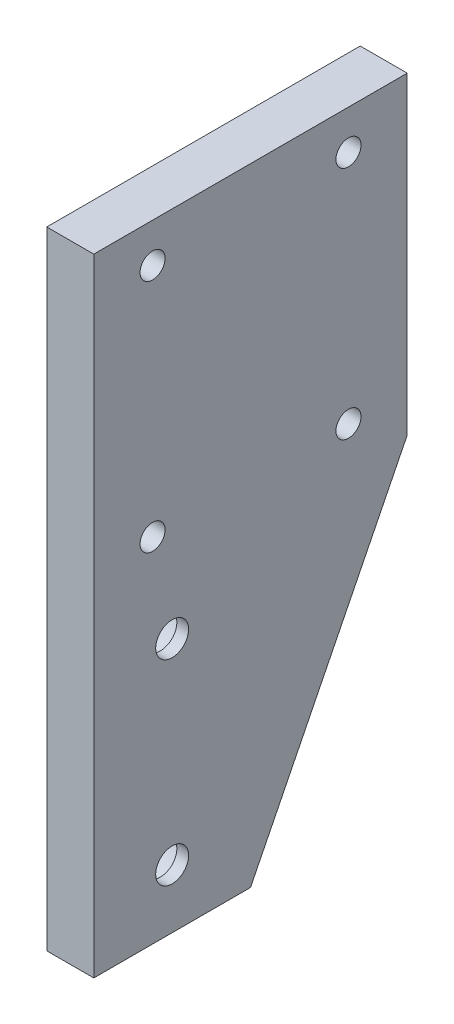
ISO-10303-21;
HEADER;
FILE_DESCRIPTION(('STEP AP214'),'2;1');
FILE_NAME('part.step','',(''),(''),'','','');
FILE_SCHEMA(('AUTOMOTIVE_DESIGN { 1 0 10303 214 1 1 1 1 }'));
ENDSEC;
DATA;
#1=APPLICATION_CONTEXT('core data for automotive mechanical design processes');
#2=APPLICATION_PROTOCOL_DEFINITION('international standard','automotive_design',2000,#1);
#3=PRODUCT_CONTEXT('',#1,'mechanical');
#4=PRODUCT('Part','Part','',(#3));
#5=PRODUCT_RELATED_PRODUCT_CATEGORY('part','',(#4));
#6=PRODUCT_DEFINITION_FORMATION('','',#4);
#7=PRODUCT_DEFINITION_CONTEXT('part definition',#1,'design');
#8=PRODUCT_DEFINITION('design','',#6,#7);
#9=PRODUCT_DEFINITION_SHAPE('','',#8);
#10=(LENGTH_UNIT() NAMED_UNIT(*) SI_UNIT(.MILLI.,.METRE.));
#11=(NAMED_UNIT(*) PLANE_ANGLE_UNIT() SI_UNIT($,.RADIAN.));
#12=(NAMED_UNIT(*) SI_UNIT($,.STERADIAN.) SOLID_ANGLE_UNIT());
#13=UNCERTAINTY_MEASURE_WITH_UNIT(LENGTH_MEASURE(1.E-05),#10,'distance_accuracy_value','');
#14=(GEOMETRIC_REPRESENTATION_CONTEXT(3) GLOBAL_UNCERTAINTY_ASSIGNED_CONTEXT((#13)) GLOBAL_UNIT_ASSIGNED_CONTEXT((#10,
#11,#12)) REPRESENTATION_CONTEXT('',''));
#15=CARTESIAN_POINT('',(0.,0.,0.));
#16=DIRECTION('',(0.,0.,1.));
#17=DIRECTION('',(1.,0.,0.));
#18=AXIS2_PLACEMENT_3D('',#15,#16,#17);
#19=CARTESIAN_POINT('',(0.,70.,-25.));
#20=DIRECTION('',(-1.,0.,0.));
#21=DIRECTION('',(0.,0.,1.));
#22=AXIS2_PLACEMENT_3D('',#19,#20,#21);
#23=CYLINDRICAL_SURFACE('',#22,5.50000000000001);
#24=CARTESIAN_POINT('',(0.,70.,-25.));
#25=DIRECTION('',(-1.,0.,0.));
#26=DIRECTION('',(0.,0.,1.));
#27=AXIS2_PLACEMENT_3D('',#24,#25,#26);
#28=CIRCLE('',#27,5.50000000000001);
#29=CARTESIAN_POINT('',(0.,70.,-19.5));
#30=VERTEX_POINT('',#29);
#31=EDGE_CURVE('E138',#30,#30,#28,.F.);
#32=ORIENTED_EDGE('',*,*,#31,.F.);
#33=EDGE_LOOP('',(#32));
#34=FACE_BOUND('',#33,.T.);
#35=CARTESIAN_POINT('',(6.8,70.,-25.));
#36=DIRECTION('',(-1.,0.,0.));
#37=DIRECTION('',(0.,0.,1.));
#38=AXIS2_PLACEMENT_3D('',#35,#36,#37);
#39=CIRCLE('',#38,5.50000000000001);
#40=CARTESIAN_POINT('',(6.8,70.,-19.5));
#41=VERTEX_POINT('',#40);
#42=EDGE_CURVE('E20',#41,#41,#39,.F.);
#43=ORIENTED_EDGE('',*,*,#42,.T.);
#44=EDGE_LOOP('',(#43));
#45=FACE_BOUND('',#44,.T.);
#46=ADVANCED_FACE('F17',(#34,#45),#23,.F.);
#47=CARTESIAN_POINT('',(0.,70.,25.));
#48=DIRECTION('',(-1.,0.,0.));
#49=DIRECTION('',(0.,0.,1.));
#50=AXIS2_PLACEMENT_3D('',#47,#48,#49);
#51=CYLINDRICAL_SURFACE('',#50,5.50000000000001);
#52=CARTESIAN_POINT('',(0.,70.,25.));
#53=DIRECTION('',(-1.,0.,0.));
#54=DIRECTION('',(0.,0.,1.));
#55=AXIS2_PLACEMENT_3D('',#52,#53,#54);
#56=CIRCLE('',#55,5.50000000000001);
#57=CARTESIAN_POINT('',(0.,70.,30.5));
#58=VERTEX_POINT('',#57);
#59=EDGE_CURVE('E135',#58,#58,#56,.F.);
#60=ORIENTED_EDGE('',*,*,#59,.F.);
#61=EDGE_LOOP('',(#60));
#62=FACE_BOUND('',#61,.T.);
#63=CARTESIAN_POINT('',(6.8,70.,25.));
#64=DIRECTION('',(-1.,0.,0.));
#65=DIRECTION('',(0.,0.,1.));
#66=AXIS2_PLACEMENT_3D('',#63,#64,#65);
#67=CIRCLE('',#66,5.50000000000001);
#68=CARTESIAN_POINT('',(6.8,70.,30.5));
#69=VERTEX_POINT('',#68);
#70=EDGE_CURVE('E152',#69,#69,#67,.F.);
#71=ORIENTED_EDGE('',*,*,#70,.T.);
#72=EDGE_LOOP('',(#71));
#73=FACE_BOUND('',#72,.T.);
#74=ADVANCED_FACE('F257',(#62,#73),#51,.F.);
#75=CARTESIAN_POINT('',(0.,9.99999999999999,-25.));
#76=DIRECTION('',(-1.,0.,0.));
#77=DIRECTION('',(0.,0.,1.));
#78=AXIS2_PLACEMENT_3D('',#75,#76,#77);
#79=CYLINDRICAL_SURFACE('',#78,5.5);
#80=CARTESIAN_POINT('',(0.,9.99999999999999,-25.));
#81=DIRECTION('',(-1.,0.,0.));
#82=DIRECTION('',(0.,0.,1.));
#83=AXIS2_PLACEMENT_3D('',#80,#81,#82);
#84=CIRCLE('',#83,5.5);
#85=CARTESIAN_POINT('',(0.,9.99999999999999,-19.5));
#86=VERTEX_POINT('',#85);
#87=EDGE_CURVE('E132',#86,#86,#84,.F.);
#88=ORIENTED_EDGE('',*,*,#87,.F.);
#89=EDGE_LOOP('',(#88));
#90=FACE_BOUND('',#89,.T.);
#91=CARTESIAN_POINT('',(6.8,9.99999999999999,-25.));
#92=DIRECTION('',(-1.,0.,0.));
#93=DIRECTION('',(0.,0.,1.));
#94=AXIS2_PLACEMENT_3D('',#91,#92,#93);
#95=CIRCLE('',#94,5.5);
#96=CARTESIAN_POINT('',(6.8,9.99999999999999,-19.5));
#97=VERTEX_POINT('',#96);
#98=EDGE_CURVE('E150',#97,#97,#95,.F.);
#99=ORIENTED_EDGE('',*,*,#98,.T.);
#100=EDGE_LOOP('',(#99));
#101=FACE_BOUND('',#100,.T.);
#102=ADVANCED_FACE('F254',(#90,#101),#79,.F.);
#103=CARTESIAN_POINT('',(0.,9.99999999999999,25.));
#104=DIRECTION('',(-1.,0.,0.));
#105=DIRECTION('',(0.,0.,1.));
#106=AXIS2_PLACEMENT_3D('',#103,#104,#105);
#107=CYLINDRICAL_SURFACE('',#106,5.5);
#108=CARTESIAN_POINT('',(0.,9.99999999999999,25.));
#109=DIRECTION('',(-1.,0.,0.));
#110=DIRECTION('',(0.,0.,1.));
#111=AXIS2_PLACEMENT_3D('',#108,#109,#110);
#112=CIRCLE('',#111,5.5);
#113=CARTESIAN_POINT('',(0.,9.99999999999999,30.5));
#114=VERTEX_POINT('',#113);
#115=EDGE_CURVE('E129',#114,#114,#112,.F.);
#116=ORIENTED_EDGE('',*,*,#115,.F.);
#117=EDGE_LOOP('',(#116));
#118=FACE_BOUND('',#117,.T.);
#119=CARTESIAN_POINT('',(6.8,9.99999999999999,25.));
#120=DIRECTION('',(-1.,0.,0.));
#121=DIRECTION('',(0.,0.,1.));
#122=AXIS2_PLACEMENT_3D('',#119,#120,#121);
#123=CIRCLE('',#122,5.5);
#124=CARTESIAN_POINT('',(6.8,9.99999999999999,30.5));
#125=VERTEX_POINT('',#124);
#126=EDGE_CURVE('E147',#125,#125,#123,.F.);
#127=ORIENTED_EDGE('',*,*,#126,.T.);
#128=EDGE_LOOP('',(#127));
#129=FACE_BOUND('',#128,.T.);
#130=ADVANCED_FACE('F250',(#118,#129),#107,.F.);
#131=CARTESIAN_POINT('',(0.,-65.,20.));
#132=DIRECTION('',(-1.,0.,0.));
#133=DIRECTION('',(0.,0.,1.));
#134=AXIS2_PLACEMENT_3D('',#131,#132,#133);
#135=CYLINDRICAL_SURFACE('',#134,7.5);
#136=CARTESIAN_POINT('',(0.,-65.,20.));
#137=DIRECTION('',(-1.,0.,0.));
#138=DIRECTION('',(0.,0.,1.));
#139=AXIS2_PLACEMENT_3D('',#136,#137,#138);
#140=CIRCLE('',#139,7.5);
#141=CARTESIAN_POINT('',(0.,-65.,27.5));
#142=VERTEX_POINT('',#141);
#143=EDGE_CURVE('E126',#142,#142,#140,.F.);
#144=ORIENTED_EDGE('',*,*,#143,.F.);
#145=EDGE_LOOP('',(#144));
#146=FACE_BOUND('',#145,.T.);
#147=CARTESIAN_POINT('',(9.,-65.,20.));
#148=DIRECTION('',(-1.,0.,0.));
#149=DIRECTION('',(0.,0.,1.));
#150=AXIS2_PLACEMENT_3D('',#147,#148,#149);
#151=CIRCLE('',#150,7.5);
#152=CARTESIAN_POINT('',(9.,-65.,27.5));
#153=VERTEX_POINT('',#152);
#154=EDGE_CURVE('E144',#153,#153,#151,.F.);
#155=ORIENTED_EDGE('',*,*,#154,.T.);
#156=EDGE_LOOP('',(#155));
#157=FACE_BOUND('',#156,.T.);
#158=ADVANCED_FACE('F246',(#146,#157),#135,.F.);
#159=CARTESIAN_POINT('',(0.,-15.,20.));
#160=DIRECTION('',(-1.,0.,0.));
#161=DIRECTION('',(0.,0.,1.));
#162=AXIS2_PLACEMENT_3D('',#159,#160,#161);
#163=CYLINDRICAL_SURFACE('',#162,7.5);
#164=CARTESIAN_POINT('',(0.,-15.,20.));
#165=DIRECTION('',(-1.,0.,0.));
#166=DIRECTION('',(0.,0.,1.));
#167=AXIS2_PLACEMENT_3D('',#164,#165,#166);
#168=CIRCLE('',#167,7.5);
#169=CARTESIAN_POINT('',(0.,-15.,27.5));
#170=VERTEX_POINT('',#169);
#171=EDGE_CURVE('E123',#170,#170,#168,.F.);
#172=ORIENTED_EDGE('',*,*,#171,.F.);
#173=EDGE_LOOP('',(#172));
#174=FACE_BOUND('',#173,.T.);
#175=CARTESIAN_POINT('',(9.,-15.,20.));
#176=DIRECTION('',(-1.,0.,0.));
#177=DIRECTION('',(0.,0.,1.));
#178=AXIS2_PLACEMENT_3D('',#175,#176,#177);
#179=CIRCLE('',#178,7.5);
#180=CARTESIAN_POINT('',(9.,-15.,27.5));
#181=VERTEX_POINT('',#180);
#182=EDGE_CURVE('E141',#181,#181,#179,.F.);
#183=ORIENTED_EDGE('',*,*,#182,.T.);
#184=EDGE_LOOP('',(#183));
#185=FACE_BOUND('',#184,.T.);
#186=ADVANCED_FACE('F164',(#174,#185),#163,.F.);
#187=CARTESIAN_POINT('',(6.8,73.2,-25.));
#188=DIRECTION('',(1.,0.,0.));
#189=DIRECTION('',(0.,0.,-1.));
#190=AXIS2_PLACEMENT_3D('',#187,#188,#189);
#191=PLANE('',#190);
#192=ORIENTED_EDGE('',*,*,#42,.F.);
#193=EDGE_LOOP('',(#192));
#194=FACE_BOUND('',#193,.T.);
#195=CARTESIAN_POINT('',(6.8,70.,-25.));
#196=DIRECTION('',(-1.,0.,0.));
#197=DIRECTION('',(0.,0.,1.));
#198=AXIS2_PLACEMENT_3D('',#195,#196,#197);
#199=CIRCLE('',#198,3.19999999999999);
#200=CARTESIAN_POINT('',(6.8,70.,-21.8));
#201=VERTEX_POINT('',#200);
#202=EDGE_CURVE('E120',#201,#201,#199,.F.);
#203=ORIENTED_EDGE('',*,*,#202,.T.);
#204=EDGE_LOOP('',(#203));
#205=FACE_BOUND('',#204,.T.);
#206=ADVANCED_FACE('F160',(#194,#205),#191,.F.);
#207=CARTESIAN_POINT('',(6.8,73.2,25.));
#208=DIRECTION('',(1.,0.,0.));
#209=DIRECTION('',(0.,0.,-1.));
#210=AXIS2_PLACEMENT_3D('',#207,#208,#209);
#211=PLANE('',#210);
#212=ORIENTED_EDGE('',*,*,#70,.F.);
#213=EDGE_LOOP('',(#212));
#214=FACE_BOUND('',#213,.T.);
#215=CARTESIAN_POINT('',(6.8,70.,25.));
#216=DIRECTION('',(-1.,0.,0.));
#217=DIRECTION('',(0.,0.,1.));
#218=AXIS2_PLACEMENT_3D('',#215,#216,#217);
#219=CIRCLE('',#218,3.19999999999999);
#220=CARTESIAN_POINT('',(6.8,70.,28.2));
#221=VERTEX_POINT('',#220);
#222=EDGE_CURVE('E117',#221,#221,#219,.F.);
#223=ORIENTED_EDGE('',*,*,#222,.T.);
#224=EDGE_LOOP('',(#223));
#225=FACE_BOUND('',#224,.T.);
#226=ADVANCED_FACE('F163',(#214,#225),#211,.F.);
#227=CARTESIAN_POINT('',(6.8,13.2,-25.));
#228=DIRECTION('',(1.,0.,0.));
#229=DIRECTION('',(0.,0.,-1.));
#230=AXIS2_PLACEMENT_3D('',#227,#228,#229);
#231=PLANE('',#230);
#232=ORIENTED_EDGE('',*,*,#98,.F.);
#233=EDGE_LOOP('',(#232));
#234=FACE_BOUND('',#233,.T.);
#235=CARTESIAN_POINT('',(6.8,9.99999999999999,-25.));
#236=DIRECTION('',(-1.,0.,0.));
#237=DIRECTION('',(0.,0.,1.));
#238=AXIS2_PLACEMENT_3D('',#235,#236,#237);
#239=CIRCLE('',#238,3.2);
#240=CARTESIAN_POINT('',(6.8,9.99999999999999,-21.8));
#241=VERTEX_POINT('',#240);
#242=EDGE_CURVE('E114',#241,#241,#239,.F.);
#243=ORIENTED_EDGE('',*,*,#242,.T.);
#244=EDGE_LOOP('',(#243));
#245=FACE_BOUND('',#244,.T.);
#246=ADVANCED_FACE('F227',(#234,#245),#231,.F.);
#247=CARTESIAN_POINT('',(6.8,13.2,25.));
#248=DIRECTION('',(1.,0.,0.));
#249=DIRECTION('',(0.,0.,-1.));
#250=AXIS2_PLACEMENT_3D('',#247,#248,#249);
#251=PLANE('',#250);
#252=ORIENTED_EDGE('',*,*,#126,.F.);
#253=EDGE_LOOP('',(#252));
#254=FACE_BOUND('',#253,.T.);
#255=CARTESIAN_POINT('',(6.8,9.99999999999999,25.));
#256=DIRECTION('',(-1.,0.,0.));
#257=DIRECTION('',(0.,0.,1.));
#258=AXIS2_PLACEMENT_3D('',#255,#256,#257);
#259=CIRCLE('',#258,3.2);
#260=CARTESIAN_POINT('',(6.8,9.99999999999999,28.2));
#261=VERTEX_POINT('',#260);
#262=EDGE_CURVE('E111',#261,#261,#259,.F.);
#263=ORIENTED_EDGE('',*,*,#262,.T.);
#264=EDGE_LOOP('',(#263));
#265=FACE_BOUND('',#264,.T.);
#266=ADVANCED_FACE('F229',(#254,#265),#251,.F.);
#267=CARTESIAN_POINT('',(9.,-60.8,20.));
#268=DIRECTION('',(1.,0.,0.));
#269=DIRECTION('',(0.,0.,-1.));
#270=AXIS2_PLACEMENT_3D('',#267,#268,#269);
#271=PLANE('',#270);
#272=ORIENTED_EDGE('',*,*,#154,.F.);
#273=EDGE_LOOP('',(#272));
#274=FACE_BOUND('',#273,.T.);
#275=CARTESIAN_POINT('',(9.,-65.,20.));
#276=DIRECTION('',(-1.,0.,0.));
#277=DIRECTION('',(0.,0.,1.));
#278=AXIS2_PLACEMENT_3D('',#275,#276,#277);
#279=CIRCLE('',#278,4.2);
#280=CARTESIAN_POINT('',(9.,-65.,24.2));
#281=VERTEX_POINT('',#280);
#282=EDGE_CURVE('E108',#281,#281,#279,.F.);
#283=ORIENTED_EDGE('',*,*,#282,.T.);
#284=EDGE_LOOP('',(#283));
#285=FACE_BOUND('',#284,.T.);
#286=ADVANCED_FACE('F236',(#274,#285),#271,.F.);
#287=CARTESIAN_POINT('',(9.,-10.8,20.));
#288=DIRECTION('',(1.,0.,0.));
#289=DIRECTION('',(0.,0.,-1.));
#290=AXIS2_PLACEMENT_3D('',#287,#288,#289);
#291=PLANE('',#290);
#292=ORIENTED_EDGE('',*,*,#182,.F.);
#293=EDGE_LOOP('',(#292));
#294=FACE_BOUND('',#293,.T.);
#295=CARTESIAN_POINT('',(9.,-15.,20.));
#296=DIRECTION('',(-1.,0.,0.));
#297=DIRECTION('',(0.,0.,1.));
#298=AXIS2_PLACEMENT_3D('',#295,#296,#297);
#299=CIRCLE('',#298,4.2);
#300=CARTESIAN_POINT('',(9.,-15.,24.2));
#301=VERTEX_POINT('',#300);
#302=EDGE_CURVE('E73',#301,#301,#299,.F.);
#303=ORIENTED_EDGE('',*,*,#302,.T.);
#304=EDGE_LOOP('',(#303));
#305=FACE_BOUND('',#304,.T.);
#306=ADVANCED_FACE('F181',(#294,#305),#291,.F.);
#307=CARTESIAN_POINT('',(0.,0.,0.));
#308=DIRECTION('',(-1.,0.,0.));
#309=DIRECTION('',(0.,0.,1.));
#310=AXIS2_PLACEMENT_3D('',#307,#308,#309);
#311=PLANE('',#310);
#312=DIRECTION('',(0.,0.,-1.));
#313=VECTOR('',#312,1.);
#314=CARTESIAN_POINT('',(0.,80.,40.));
#315=LINE('',#314,#313);
#316=CARTESIAN_POINT('',(0.,80.,40.));
#317=VERTEX_POINT('',#316);
#318=CARTESIAN_POINT('',(0.,80.,-40.));
#319=VERTEX_POINT('',#318);
#320=EDGE_CURVE('E61',#317,#319,#315,.T.);
#321=ORIENTED_EDGE('',*,*,#320,.T.);
#322=DIRECTION('',(0.,1.,0.));
#323=VECTOR('',#322,1.);
#324=CARTESIAN_POINT('',(0.,-80.,-40.));
#325=LINE('',#324,#323);
#326=CARTESIAN_POINT('',(0.,0.,-40.));
#327=VERTEX_POINT('',#326);
#328=EDGE_CURVE('E460',#319,#327,#325,.F.);
#329=ORIENTED_EDGE('',*,*,#328,.T.);
#330=DIRECTION('',(0.,-0.894427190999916,0.447213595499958));
#331=VECTOR('',#330,1.);
#332=CARTESIAN_POINT('',(0.,-80.,0.));
#333=LINE('',#332,#331);
#334=CARTESIAN_POINT('',(0.,-80.,0.));
#335=VERTEX_POINT('',#334);
#336=EDGE_CURVE('E465',#327,#335,#333,.T.);
#337=ORIENTED_EDGE('',*,*,#336,.T.);
#338=DIRECTION('',(0.,0.,1.));
#339=VECTOR('',#338,1.);
#340=CARTESIAN_POINT('',(0.,-80.,40.));
#341=LINE('',#340,#339);
#342=CARTESIAN_POINT('',(0.,-80.,40.));
#343=VERTEX_POINT('',#342);
#344=EDGE_CURVE('E67',#335,#343,#341,.T.);
#345=ORIENTED_EDGE('',*,*,#344,.T.);
#346=DIRECTION('',(0.,1.,0.));
#347=VECTOR('',#346,1.);
#348=CARTESIAN_POINT('',(0.,-80.,40.));
#349=LINE('',#348,#347);
#350=EDGE_CURVE('E64',#343,#317,#349,.T.);
#351=ORIENTED_EDGE('',*,*,#350,.T.);
#352=EDGE_LOOP('',(#321,#329,#337,#345,#351));
#353=FACE_BOUND('',#352,.T.);
#354=ORIENTED_EDGE('',*,*,#171,.T.);
#355=EDGE_LOOP('',(#354));
#356=FACE_BOUND('',#355,.T.);
#357=ORIENTED_EDGE('',*,*,#143,.T.);
#358=EDGE_LOOP('',(#357));
#359=FACE_BOUND('',#358,.T.);
#360=ORIENTED_EDGE('',*,*,#115,.T.);
#361=EDGE_LOOP('',(#360));
#362=FACE_BOUND('',#361,.T.);
#363=ORIENTED_EDGE('',*,*,#87,.T.);
#364=EDGE_LOOP('',(#363));
#365=FACE_BOUND('',#364,.T.);
#366=ORIENTED_EDGE('',*,*,#59,.T.);
#367=EDGE_LOOP('',(#366));
#368=FACE_BOUND('',#367,.T.);
#369=ORIENTED_EDGE('',*,*,#31,.T.);
#370=EDGE_LOOP('',(#369));
#371=FACE_BOUND('',#370,.T.);
#372=ADVANCED_FACE('F65',(#353,#356,#359,#362,#365,#368,#371),#311,.T.);
#373=CARTESIAN_POINT('',(0.,70.,-25.));
#374=DIRECTION('',(-1.,0.,0.));
#375=DIRECTION('',(0.,0.,1.));
#376=AXIS2_PLACEMENT_3D('',#373,#374,#375);
#377=CYLINDRICAL_SURFACE('',#376,3.19999999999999);
#378=CARTESIAN_POINT('',(12.,70.,-25.));
#379=DIRECTION('',(-1.,0.,0.));
#380=DIRECTION('',(0.,0.,1.));
#381=AXIS2_PLACEMENT_3D('',#378,#379,#380);
#382=CIRCLE('',#381,3.19999999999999);
#383=CARTESIAN_POINT('',(12.,70.,-21.8));
#384=VERTEX_POINT('',#383);
#385=EDGE_CURVE('E103',#384,#384,#382,.F.);
#386=ORIENTED_EDGE('',*,*,#385,.T.);
#387=EDGE_LOOP('',(#386));
#388=FACE_BOUND('',#387,.T.);
#389=ORIENTED_EDGE('',*,*,#202,.F.);
#390=EDGE_LOOP('',(#389));
#391=FACE_BOUND('',#390,.T.);
#392=ADVANCED_FACE('F168',(#388,#391),#377,.F.);
#393=CARTESIAN_POINT('',(0.,70.,25.));
#394=DIRECTION('',(-1.,0.,0.));
#395=DIRECTION('',(0.,0.,1.));
#396=AXIS2_PLACEMENT_3D('',#393,#394,#395);
#397=CYLINDRICAL_SURFACE('',#396,3.19999999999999);
#398=CARTESIAN_POINT('',(12.,70.,25.));
#399=DIRECTION('',(-1.,0.,0.));
#400=DIRECTION('',(0.,0.,1.));
#401=AXIS2_PLACEMENT_3D('',#398,#399,#400);
#402=CIRCLE('',#401,3.19999999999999);
#403=CARTESIAN_POINT('',(12.,70.,28.2));
#404=VERTEX_POINT('',#403);
#405=EDGE_CURVE('E100',#404,#404,#402,.F.);
#406=ORIENTED_EDGE('',*,*,#405,.T.);
#407=EDGE_LOOP('',(#406));
#408=FACE_BOUND('',#407,.T.);
#409=ORIENTED_EDGE('',*,*,#222,.F.);
#410=EDGE_LOOP('',(#409));
#411=FACE_BOUND('',#410,.T.);
#412=ADVANCED_FACE('F170',(#408,#411),#397,.F.);
#413=CARTESIAN_POINT('',(0.,9.99999999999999,-25.));
#414=DIRECTION('',(-1.,0.,0.));
#415=DIRECTION('',(0.,0.,1.));
#416=AXIS2_PLACEMENT_3D('',#413,#414,#415);
#417=CYLINDRICAL_SURFACE('',#416,3.2);
#418=CARTESIAN_POINT('',(12.,9.99999999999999,-25.));
#419=DIRECTION('',(-1.,0.,0.));
#420=DIRECTION('',(0.,0.,1.));
#421=AXIS2_PLACEMENT_3D('',#418,#419,#420);
#422=CIRCLE('',#421,3.2);
#423=CARTESIAN_POINT('',(12.,9.99999999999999,-21.8));
#424=VERTEX_POINT('',#423);
#425=EDGE_CURVE('E97',#424,#424,#422,.F.);
#426=ORIENTED_EDGE('',*,*,#425,.T.);
#427=EDGE_LOOP('',(#426));
#428=FACE_BOUND('',#427,.T.);
#429=ORIENTED_EDGE('',*,*,#242,.F.);
#430=EDGE_LOOP('',(#429));
#431=FACE_BOUND('',#430,.T.);
#432=ADVANCED_FACE('F178',(#428,#431),#417,.F.);
#433=CARTESIAN_POINT('',(0.,9.99999999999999,25.));
#434=DIRECTION('',(-1.,0.,0.));
#435=DIRECTION('',(0.,0.,1.));
#436=AXIS2_PLACEMENT_3D('',#433,#434,#435);
#437=CYLINDRICAL_SURFACE('',#436,3.2);
#438=CARTESIAN_POINT('',(12.,9.99999999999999,25.));
#439=DIRECTION('',(-1.,0.,0.));
#440=DIRECTION('',(0.,0.,1.));
#441=AXIS2_PLACEMENT_3D('',#438,#439,#440);
#442=CIRCLE('',#441,3.2);
#443=CARTESIAN_POINT('',(12.,9.99999999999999,28.2));
#444=VERTEX_POINT('',#443);
#445=EDGE_CURVE('E94',#444,#444,#442,.F.);
#446=ORIENTED_EDGE('',*,*,#445,.T.);
#447=EDGE_LOOP('',(#446));
#448=FACE_BOUND('',#447,.T.);
#449=ORIENTED_EDGE('',*,*,#262,.F.);
#450=EDGE_LOOP('',(#449));
#451=FACE_BOUND('',#450,.T.);
#452=ADVANCED_FACE('F214',(#448,#451),#437,.F.);
#453=CARTESIAN_POINT('',(0.,-65.,20.));
#454=DIRECTION('',(-1.,0.,0.));
#455=DIRECTION('',(0.,0.,1.));
#456=AXIS2_PLACEMENT_3D('',#453,#454,#455);
#457=CYLINDRICAL_SURFACE('',#456,4.2);
#458=CARTESIAN_POINT('',(12.,-65.,20.));
#459=DIRECTION('',(-1.,0.,0.));
#460=DIRECTION('',(0.,0.,1.));
#461=AXIS2_PLACEMENT_3D('',#458,#459,#460);
#462=CIRCLE('',#461,4.2);
#463=CARTESIAN_POINT('',(12.,-65.,24.2));
#464=VERTEX_POINT('',#463);
#465=EDGE_CURVE('E91',#464,#464,#462,.F.);
#466=ORIENTED_EDGE('',*,*,#465,.T.);
#467=EDGE_LOOP('',(#466));
#468=FACE_BOUND('',#467,.T.);
#469=ORIENTED_EDGE('',*,*,#282,.F.);
#470=EDGE_LOOP('',(#469));
#471=FACE_BOUND('',#470,.T.);
#472=ADVANCED_FACE('F210',(#468,#471),#457,.F.);
#473=CARTESIAN_POINT('',(0.,-15.,20.));
#474=DIRECTION('',(-1.,0.,0.));
#475=DIRECTION('',(0.,0.,1.));
#476=AXIS2_PLACEMENT_3D('',#473,#474,#475);
#477=CYLINDRICAL_SURFACE('',#476,4.2);
#478=CARTESIAN_POINT('',(12.,-15.,20.));
#479=DIRECTION('',(-1.,0.,0.));
#480=DIRECTION('',(0.,0.,1.));
#481=AXIS2_PLACEMENT_3D('',#478,#479,#480);
#482=CIRCLE('',#481,4.2);
#483=CARTESIAN_POINT('',(12.,-15.,24.2));
#484=VERTEX_POINT('',#483);
#485=EDGE_CURVE('E88',#484,#484,#482,.F.);
#486=ORIENTED_EDGE('',*,*,#485,.T.);
#487=EDGE_LOOP('',(#486));
#488=FACE_BOUND('',#487,.T.);
#489=ORIENTED_EDGE('',*,*,#302,.F.);
#490=EDGE_LOOP('',(#489));
#491=FACE_BOUND('',#490,.T.);
#492=ADVANCED_FACE('F207',(#488,#491),#477,.F.);
#493=CARTESIAN_POINT('',(12.,-80.,40.));
#494=DIRECTION('',(0.,0.,-1.));
#495=DIRECTION('',(-1.,0.,0.));
#496=AXIS2_PLACEMENT_3D('',#493,#494,#495);
#497=PLANE('',#496);
#498=DIRECTION('',(1.,0.,0.));
#499=VECTOR('',#498,1.);
#500=CARTESIAN_POINT('',(12.,-80.,40.));
#501=LINE('',#500,#499);
#502=CARTESIAN_POINT('',(12.,-80.,40.));
#503=VERTEX_POINT('',#502);
#504=EDGE_CURVE('E467',#343,#503,#501,.T.);
#505=ORIENTED_EDGE('',*,*,#504,.T.);
#506=DIRECTION('',(0.,1.,0.));
#507=VECTOR('',#506,1.);
#508=CARTESIAN_POINT('',(12.,0.,40.));
#509=LINE('',#508,#507);
#510=CARTESIAN_POINT('',(12.,80.,40.));
#511=VERTEX_POINT('',#510);
#512=EDGE_CURVE('E84',#503,#511,#509,.T.);
#513=ORIENTED_EDGE('',*,*,#512,.T.);
#514=DIRECTION('',(1.,0.,0.));
#515=VECTOR('',#514,1.);
#516=CARTESIAN_POINT('',(12.,80.,40.));
#517=LINE('',#516,#515);
#518=EDGE_CURVE('E72',#511,#317,#517,.F.);
#519=ORIENTED_EDGE('',*,*,#518,.T.);
#520=ORIENTED_EDGE('',*,*,#350,.F.);
#521=EDGE_LOOP('',(#505,#513,#519,#520));
#522=FACE_BOUND('',#521,.T.);
#523=ADVANCED_FACE('F83',(#522),#497,.F.);
#524=CARTESIAN_POINT('',(12.,80.,40.));
#525=DIRECTION('',(0.,-1.,0.));
#526=DIRECTION('',(0.,0.,-1.));
#527=AXIS2_PLACEMENT_3D('',#524,#525,#526);
#528=PLANE('',#527);
#529=ORIENTED_EDGE('',*,*,#518,.F.);
#530=DIRECTION('',(0.,0.,1.));
#531=VECTOR('',#530,1.);
#532=CARTESIAN_POINT('',(12.,80.,0.));
#533=LINE('',#532,#531);
#534=CARTESIAN_POINT('',(12.,80.,-40.));
#535=VERTEX_POINT('',#534);
#536=EDGE_CURVE('E475',#511,#535,#533,.F.);
#537=ORIENTED_EDGE('',*,*,#536,.T.);
#538=DIRECTION('',(1.,0.,0.));
#539=VECTOR('',#538,1.);
#540=CARTESIAN_POINT('',(12.,80.,-40.));
#541=LINE('',#540,#539);
#542=EDGE_CURVE('E80',#535,#319,#541,.F.);
#543=ORIENTED_EDGE('',*,*,#542,.T.);
#544=ORIENTED_EDGE('',*,*,#320,.F.);
#545=EDGE_LOOP('',(#529,#537,#543,#544));
#546=FACE_BOUND('',#545,.T.);
#547=ADVANCED_FACE('F77',(#546),#528,.F.);
#548=CARTESIAN_POINT('',(12.,-80.,-40.));
#549=DIRECTION('',(0.,0.,1.));
#550=DIRECTION('',(1.,0.,0.));
#551=AXIS2_PLACEMENT_3D('',#548,#549,#550);
#552=PLANE('',#551);
#553=DIRECTION('',(1.,0.,0.));
#554=VECTOR('',#553,1.);
#555=CARTESIAN_POINT('',(0.,0.,-40.));
#556=LINE('',#555,#554);
#557=CARTESIAN_POINT('',(12.,0.,-40.));
#558=VERTEX_POINT('',#557);
#559=EDGE_CURVE('E459',#558,#327,#556,.F.);
#560=ORIENTED_EDGE('',*,*,#559,.T.);
#561=ORIENTED_EDGE('',*,*,#328,.F.);
#562=ORIENTED_EDGE('',*,*,#542,.F.);
#563=DIRECTION('',(0.,1.,0.));
#564=VECTOR('',#563,1.);
#565=CARTESIAN_POINT('',(12.,0.,-40.));
#566=LINE('',#565,#564);
#567=EDGE_CURVE('E462',#535,#558,#566,.F.);
#568=ORIENTED_EDGE('',*,*,#567,.T.);
#569=EDGE_LOOP('',(#560,#561,#562,#568));
#570=FACE_BOUND('',#569,.T.);
#571=ADVANCED_FACE('F198',(#570),#552,.F.);
#572=CARTESIAN_POINT('',(0.,-80.,0.));
#573=DIRECTION('',(0.,0.447213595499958,0.894427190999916));
#574=DIRECTION('',(0.,-0.894427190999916,0.447213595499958));
#575=AXIS2_PLACEMENT_3D('',#572,#573,#574);
#576=PLANE('',#575);
#577=DIRECTION('',(1.,0.,0.));
#578=VECTOR('',#577,1.);
#579=CARTESIAN_POINT('',(12.,-80.,0.));
#580=LINE('',#579,#578);
#581=CARTESIAN_POINT('',(12.,-80.,0.));
#582=VERTEX_POINT('',#581);
#583=EDGE_CURVE('E34',#582,#335,#580,.F.);
#584=ORIENTED_EDGE('',*,*,#583,.T.);
#585=ORIENTED_EDGE('',*,*,#336,.F.);
#586=ORIENTED_EDGE('',*,*,#559,.F.);
#587=DIRECTION('',(0.,-0.894427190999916,0.447213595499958));
#588=VECTOR('',#587,1.);
#589=CARTESIAN_POINT('',(12.,0.,-40.));
#590=LINE('',#589,#588);
#591=EDGE_CURVE('E26',#558,#582,#590,.T.);
#592=ORIENTED_EDGE('',*,*,#591,.T.);
#593=EDGE_LOOP('',(#584,#585,#586,#592));
#594=FACE_BOUND('',#593,.T.);
#595=ADVANCED_FACE('F191',(#594),#576,.F.);
#596=CARTESIAN_POINT('',(12.,-80.,40.));
#597=DIRECTION('',(0.,1.,0.));
#598=DIRECTION('',(0.,0.,1.));
#599=AXIS2_PLACEMENT_3D('',#596,#597,#598);
#600=PLANE('',#599);
#601=ORIENTED_EDGE('',*,*,#583,.F.);
#602=DIRECTION('',(0.,0.,1.));
#603=VECTOR('',#602,1.);
#604=CARTESIAN_POINT('',(12.,-80.,0.));
#605=LINE('',#604,#603);
#606=EDGE_CURVE('E11',#582,#503,#605,.T.);
#607=ORIENTED_EDGE('',*,*,#606,.T.);
#608=ORIENTED_EDGE('',*,*,#504,.F.);
#609=ORIENTED_EDGE('',*,*,#344,.F.);
#610=EDGE_LOOP('',(#601,#607,#608,#609));
#611=FACE_BOUND('',#610,.T.);
#612=ADVANCED_FACE('F185',(#611),#600,.F.);
#613=CARTESIAN_POINT('',(12.,0.,0.));
#614=DIRECTION('',(-1.,0.,0.));
#615=DIRECTION('',(0.,0.,1.));
#616=AXIS2_PLACEMENT_3D('',#613,#614,#615);
#617=PLANE('',#616);
#618=ORIENTED_EDGE('',*,*,#591,.F.);
#619=ORIENTED_EDGE('',*,*,#567,.F.);
#620=ORIENTED_EDGE('',*,*,#536,.F.);
#621=ORIENTED_EDGE('',*,*,#512,.F.);
#622=ORIENTED_EDGE('',*,*,#606,.F.);
#623=EDGE_LOOP('',(#618,#619,#620,#621,#622));
#624=FACE_BOUND('',#623,.T.);
#625=ORIENTED_EDGE('',*,*,#485,.F.);
#626=EDGE_LOOP('',(#625));
#627=FACE_BOUND('',#626,.T.);
#628=ORIENTED_EDGE('',*,*,#465,.F.);
#629=EDGE_LOOP('',(#628));
#630=FACE_BOUND('',#629,.T.);
#631=ORIENTED_EDGE('',*,*,#445,.F.);
#632=EDGE_LOOP('',(#631));
#633=FACE_BOUND('',#632,.T.);
#634=ORIENTED_EDGE('',*,*,#425,.F.);
#635=EDGE_LOOP('',(#634));
#636=FACE_BOUND('',#635,.T.);
#637=ORIENTED_EDGE('',*,*,#405,.F.);
#638=EDGE_LOOP('',(#637));
#639=FACE_BOUND('',#638,.T.);
#640=ORIENTED_EDGE('',*,*,#385,.F.);
#641=EDGE_LOOP('',(#640));
#642=FACE_BOUND('',#641,.T.);
#643=ADVANCED_FACE('F183',(#624,#627,#630,#633,#636,#639,#642),#617,.F.);
#644=CLOSED_SHELL('',(#46,#74,#102,#130,#158,#186,#206,#226,#246,#266,#286,#306,#372,#392,#412,
#432,#452,#472,#492,#523,#547,#571,#595,#612,#643));
#645=MANIFOLD_SOLID_BREP('B1',#644);
#646=ADVANCED_BREP_SHAPE_REPRESENTATION('',(#18,#645),#14);
#647=SHAPE_DEFINITION_REPRESENTATION(#9,#646);
ENDSEC;
END-ISO-10303-21;
